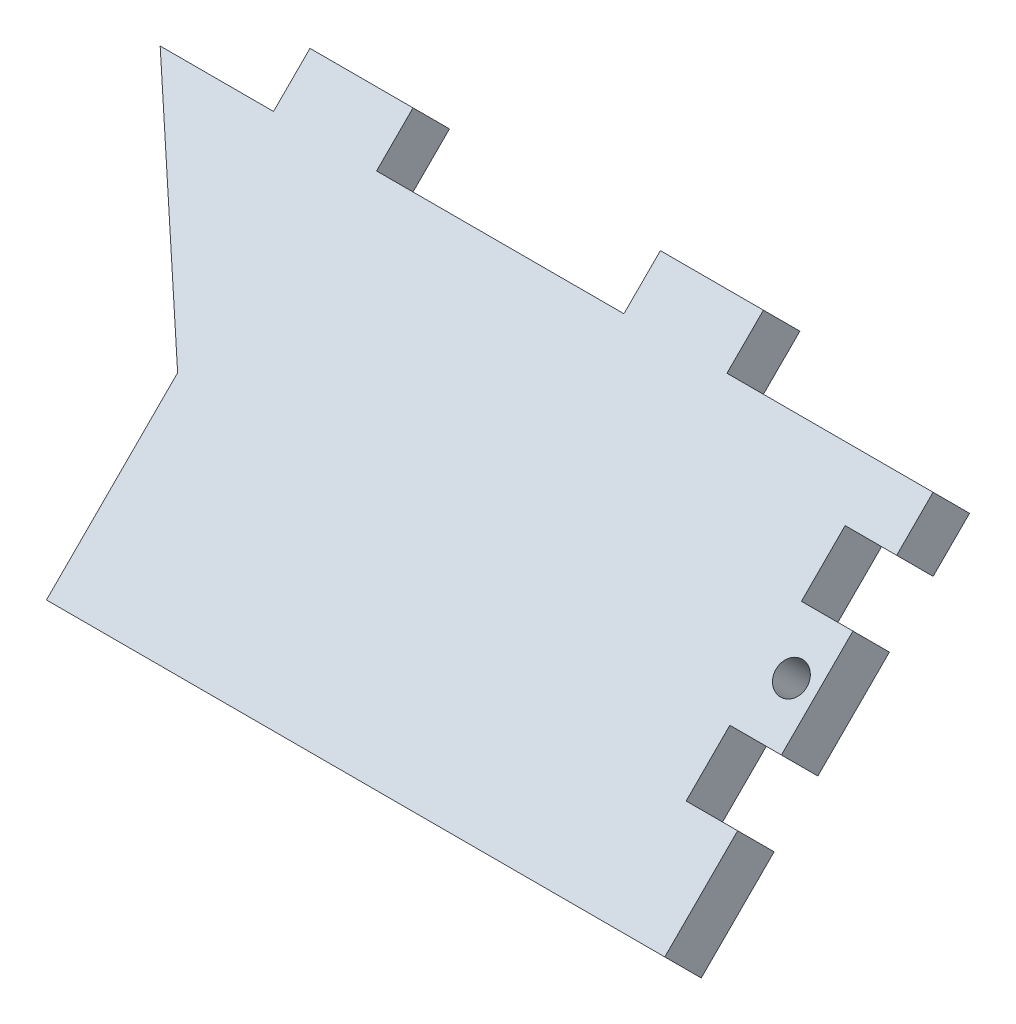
ISO-10303-21;
HEADER;
FILE_DESCRIPTION(('STEP AP214'),'2;1');
FILE_NAME('part.step','',(''),(''),'','','');
FILE_SCHEMA(('AUTOMOTIVE_DESIGN { 1 0 10303 214 1 1 1 1 }'));
ENDSEC;
DATA;
#1=APPLICATION_CONTEXT('core data for automotive mechanical design processes');
#2=APPLICATION_PROTOCOL_DEFINITION('international standard','automotive_design',2000,#1);
#3=PRODUCT_CONTEXT('',#1,'mechanical');
#4=PRODUCT('Part','Part','',(#3));
#5=PRODUCT_RELATED_PRODUCT_CATEGORY('part','',(#4));
#6=PRODUCT_DEFINITION_FORMATION('','',#4);
#7=PRODUCT_DEFINITION_CONTEXT('part definition',#1,'design');
#8=PRODUCT_DEFINITION('design','',#6,#7);
#9=PRODUCT_DEFINITION_SHAPE('','',#8);
#10=(LENGTH_UNIT() NAMED_UNIT(*) SI_UNIT(.MILLI.,.METRE.));
#11=(NAMED_UNIT(*) PLANE_ANGLE_UNIT() SI_UNIT($,.RADIAN.));
#12=(NAMED_UNIT(*) SI_UNIT($,.STERADIAN.) SOLID_ANGLE_UNIT());
#13=UNCERTAINTY_MEASURE_WITH_UNIT(LENGTH_MEASURE(1.E-05),#10,'distance_accuracy_value','');
#14=(GEOMETRIC_REPRESENTATION_CONTEXT(3) GLOBAL_UNCERTAINTY_ASSIGNED_CONTEXT((#13)) GLOBAL_UNIT_ASSIGNED_CONTEXT((#10,
#11,#12)) REPRESENTATION_CONTEXT('',''));
#15=CARTESIAN_POINT('',(0.,0.,0.));
#16=DIRECTION('',(0.,0.,1.));
#17=DIRECTION('',(1.,0.,0.));
#18=AXIS2_PLACEMENT_3D('',#15,#16,#17);
#19=CARTESIAN_POINT('',(-6.35,4.49012806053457,4.49012806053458));
#20=DIRECTION('',(1.,0.,0.));
#21=DIRECTION('',(0.,1.,0.));
#22=AXIS2_PLACEMENT_3D('',#19,#20,#21);
#23=PLANE('',#22);
#24=DIRECTION('',(0.,-0.707106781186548,0.707106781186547));
#25=VECTOR('',#24,1.);
#26=CARTESIAN_POINT('',(-6.35,0.,0.));
#27=LINE('',#26,#25);
#28=CARTESIAN_POINT('',(-6.35,14.3684097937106,-14.3684097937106));
#29=VERTEX_POINT('',#28);
#30=CARTESIAN_POINT('',(-6.35,8.98025612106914,-8.98025612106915));
#31=VERTEX_POINT('',#30);
#32=EDGE_CURVE('E226',#29,#31,#27,.T.);
#33=ORIENTED_EDGE('',*,*,#32,.F.);
#34=DIRECTION('',(0.,-0.707106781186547,-0.707106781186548));
#35=VECTOR('',#34,1.);
#36=CARTESIAN_POINT('',(-6.35,18.8585378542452,-9.87828173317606));
#37=LINE('',#36,#35);
#38=CARTESIAN_POINT('',(-6.35,18.8585378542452,-9.87828173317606));
#39=VERTEX_POINT('',#38);
#40=EDGE_CURVE('E11',#39,#29,#37,.T.);
#41=ORIENTED_EDGE('',*,*,#40,.F.);
#42=DIRECTION('',(0.,-0.707106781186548,0.707106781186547));
#43=VECTOR('',#42,1.);
#44=CARTESIAN_POINT('',(-6.35,4.49012806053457,4.49012806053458));
#45=LINE('',#44,#43);
#46=CARTESIAN_POINT('',(-6.35,13.4703841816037,-4.49012806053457));
#47=VERTEX_POINT('',#46);
#48=EDGE_CURVE('E296',#39,#47,#45,.T.);
#49=ORIENTED_EDGE('',*,*,#48,.T.);
#50=DIRECTION('',(0.,-0.707106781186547,-0.707106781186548));
#51=VECTOR('',#50,1.);
#52=CARTESIAN_POINT('',(-6.35,13.4703841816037,-4.49012806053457));
#53=LINE('',#52,#51);
#54=EDGE_CURVE('E137',#47,#31,#53,.T.);
#55=ORIENTED_EDGE('',*,*,#54,.T.);
#56=EDGE_LOOP('',(#33,#41,#49,#55));
#57=FACE_BOUND('',#56,.T.);
#58=ADVANCED_FACE('F47',(#57),#23,.T.);
#59=CARTESIAN_POINT('',(0.,18.8585378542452,-9.87828173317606));
#60=DIRECTION('',(0.,-0.707106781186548,0.707106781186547));
#61=DIRECTION('',(0.,-0.707106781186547,-0.707106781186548));
#62=AXIS2_PLACEMENT_3D('',#59,#60,#61);
#63=PLANE('',#62);
#64=DIRECTION('',(-1.,0.,0.));
#65=VECTOR('',#64,1.);
#66=CARTESIAN_POINT('',(0.,14.3684097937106,-14.3684097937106));
#67=LINE('',#66,#65);
#68=CARTESIAN_POINT('',(0.,14.3684097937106,-14.3684097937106));
#69=VERTEX_POINT('',#68);
#70=EDGE_CURVE('E230',#69,#29,#67,.T.);
#71=ORIENTED_EDGE('',*,*,#70,.F.);
#72=DIRECTION('',(0.,-0.707106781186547,-0.707106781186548));
#73=VECTOR('',#72,1.);
#74=CARTESIAN_POINT('',(0.,18.8585378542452,-9.87828173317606));
#75=LINE('',#74,#73);
#76=CARTESIAN_POINT('',(0.,18.8585378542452,-9.87828173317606));
#77=VERTEX_POINT('',#76);
#78=EDGE_CURVE('E56',#77,#69,#75,.T.);
#79=ORIENTED_EDGE('',*,*,#78,.F.);
#80=DIRECTION('',(-1.,0.,0.));
#81=VECTOR('',#80,1.);
#82=CARTESIAN_POINT('',(0.,18.8585378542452,-9.87828173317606));
#83=LINE('',#82,#81);
#84=EDGE_CURVE('E364',#77,#39,#83,.T.);
#85=ORIENTED_EDGE('',*,*,#84,.T.);
#86=ORIENTED_EDGE('',*,*,#40,.T.);
#87=EDGE_LOOP('',(#71,#79,#85,#86));
#88=FACE_BOUND('',#87,.T.);
#89=ADVANCED_FACE('F363',(#88),#63,.T.);
#90=CARTESIAN_POINT('',(0.,4.49012806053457,4.49012806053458));
#91=DIRECTION('',(-1.,0.,0.));
#92=DIRECTION('',(0.,-1.,0.));
#93=AXIS2_PLACEMENT_3D('',#90,#91,#92);
#94=PLANE('',#93);
#95=DIRECTION('',(0.,0.707106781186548,-0.707106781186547));
#96=VECTOR('',#95,1.);
#97=CARTESIAN_POINT('',(0.,0.,0.));
#98=LINE('',#97,#96);
#99=CARTESIAN_POINT('',(0.,23.1870213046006,-23.1870213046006));
#100=VERTEX_POINT('',#99);
#101=EDGE_CURVE('E235',#69,#100,#98,.T.);
#102=ORIENTED_EDGE('',*,*,#101,.T.);
#103=DIRECTION('',(0.,-0.707106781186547,-0.707106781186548));
#104=VECTOR('',#103,1.);
#105=CARTESIAN_POINT('',(0.,27.6771493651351,-18.696893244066));
#106=LINE('',#105,#104);
#107=CARTESIAN_POINT('',(0.,27.6771493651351,-18.696893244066));
#108=VERTEX_POINT('',#107);
#109=EDGE_CURVE('E347',#108,#100,#106,.T.);
#110=ORIENTED_EDGE('',*,*,#109,.F.);
#111=DIRECTION('',(0.,0.707106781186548,-0.707106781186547));
#112=VECTOR('',#111,1.);
#113=CARTESIAN_POINT('',(0.,4.49012806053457,4.49012806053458));
#114=LINE('',#113,#112);
#115=EDGE_CURVE('E212',#77,#108,#114,.T.);
#116=ORIENTED_EDGE('',*,*,#115,.F.);
#117=ORIENTED_EDGE('',*,*,#78,.T.);
#118=EDGE_LOOP('',(#102,#110,#116,#117));
#119=FACE_BOUND('',#118,.T.);
#120=ADVANCED_FACE('F354',(#119),#94,.F.);
#121=CARTESIAN_POINT('',(0.,27.6771493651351,-18.696893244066));
#122=DIRECTION('',(0.,-0.707106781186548,0.707106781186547));
#123=DIRECTION('',(0.,-0.707106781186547,-0.707106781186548));
#124=AXIS2_PLACEMENT_3D('',#121,#122,#123);
#125=PLANE('',#124);
#126=DIRECTION('',(-1.,0.,0.));
#127=VECTOR('',#126,1.);
#128=CARTESIAN_POINT('',(0.,23.1870213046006,-23.1870213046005));
#129=LINE('',#128,#127);
#130=CARTESIAN_POINT('',(-6.35,23.1870213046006,-23.1870213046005));
#131=VERTEX_POINT('',#130);
#132=EDGE_CURVE('E238',#100,#131,#129,.T.);
#133=ORIENTED_EDGE('',*,*,#132,.T.);
#134=DIRECTION('',(0.,-0.707106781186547,-0.707106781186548));
#135=VECTOR('',#134,1.);
#136=CARTESIAN_POINT('',(-6.35,27.6771493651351,-18.696893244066));
#137=LINE('',#136,#135);
#138=CARTESIAN_POINT('',(-6.35,27.6771493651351,-18.696893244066));
#139=VERTEX_POINT('',#138);
#140=EDGE_CURVE('E344',#139,#131,#137,.T.);
#141=ORIENTED_EDGE('',*,*,#140,.F.);
#142=DIRECTION('',(-1.,0.,0.));
#143=VECTOR('',#142,1.);
#144=CARTESIAN_POINT('',(0.,27.6771493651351,-18.696893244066));
#145=LINE('',#144,#143);
#146=EDGE_CURVE('E377',#108,#139,#145,.T.);
#147=ORIENTED_EDGE('',*,*,#146,.F.);
#148=ORIENTED_EDGE('',*,*,#109,.T.);
#149=EDGE_LOOP('',(#133,#141,#147,#148));
#150=FACE_BOUND('',#149,.T.);
#151=ADVANCED_FACE('F500',(#150),#125,.F.);
#152=CARTESIAN_POINT('',(-6.35,4.49012806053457,4.49012806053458));
#153=DIRECTION('',(1.,0.,0.));
#154=DIRECTION('',(0.,1.,0.));
#155=AXIS2_PLACEMENT_3D('',#152,#153,#154);
#156=PLANE('',#155);
#157=DIRECTION('',(0.,-0.707106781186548,0.707106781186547));
#158=VECTOR('',#157,1.);
#159=CARTESIAN_POINT('',(-6.35,0.,0.));
#160=LINE('',#159,#158);
#161=CARTESIAN_POINT('',(-6.35,28.575174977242,-28.575174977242));
#162=VERTEX_POINT('',#161);
#163=EDGE_CURVE('E243',#162,#131,#160,.T.);
#164=ORIENTED_EDGE('',*,*,#163,.F.);
#165=DIRECTION('',(0.,-0.707106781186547,-0.707106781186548));
#166=VECTOR('',#165,1.);
#167=CARTESIAN_POINT('',(-6.35,33.0653030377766,-24.0850469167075));
#168=LINE('',#167,#166);
#169=CARTESIAN_POINT('',(-6.35,33.0653030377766,-24.0850469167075));
#170=VERTEX_POINT('',#169);
#171=EDGE_CURVE('E341',#170,#162,#168,.T.);
#172=ORIENTED_EDGE('',*,*,#171,.F.);
#173=DIRECTION('',(0.,-0.707106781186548,0.707106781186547));
#174=VECTOR('',#173,1.);
#175=CARTESIAN_POINT('',(-6.35,4.49012806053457,4.49012806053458));
#176=LINE('',#175,#174);
#177=EDGE_CURVE('E380',#170,#139,#176,.T.);
#178=ORIENTED_EDGE('',*,*,#177,.T.);
#179=ORIENTED_EDGE('',*,*,#140,.T.);
#180=EDGE_LOOP('',(#164,#172,#178,#179));
#181=FACE_BOUND('',#180,.T.);
#182=ADVANCED_FACE('F505',(#181),#156,.T.);
#183=CARTESIAN_POINT('',(0.,33.0653030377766,-24.0850469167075));
#184=DIRECTION('',(0.,-0.707106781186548,0.707106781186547));
#185=DIRECTION('',(0.,-0.707106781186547,-0.707106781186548));
#186=AXIS2_PLACEMENT_3D('',#183,#184,#185);
#187=PLANE('',#186);
#188=DIRECTION('',(-1.,0.,0.));
#189=VECTOR('',#188,1.);
#190=CARTESIAN_POINT('',(0.,28.575174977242,-28.575174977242));
#191=LINE('',#190,#189);
#192=CARTESIAN_POINT('',(0.,28.575174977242,-28.575174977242));
#193=VERTEX_POINT('',#192);
#194=EDGE_CURVE('E247',#193,#162,#191,.T.);
#195=ORIENTED_EDGE('',*,*,#194,.F.);
#196=DIRECTION('',(0.,-0.707106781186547,-0.707106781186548));
#197=VECTOR('',#196,1.);
#198=CARTESIAN_POINT('',(0.,33.0653030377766,-24.0850469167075));
#199=LINE('',#198,#197);
#200=CARTESIAN_POINT('',(0.,33.0653030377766,-24.0850469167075));
#201=VERTEX_POINT('',#200);
#202=EDGE_CURVE('E338',#201,#193,#199,.T.);
#203=ORIENTED_EDGE('',*,*,#202,.F.);
#204=DIRECTION('',(-1.,0.,0.));
#205=VECTOR('',#204,1.);
#206=CARTESIAN_POINT('',(0.,33.0653030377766,-24.0850469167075));
#207=LINE('',#206,#205);
#208=EDGE_CURVE('E384',#201,#170,#207,.T.);
#209=ORIENTED_EDGE('',*,*,#208,.T.);
#210=ORIENTED_EDGE('',*,*,#171,.T.);
#211=EDGE_LOOP('',(#195,#203,#209,#210));
#212=FACE_BOUND('',#211,.T.);
#213=ADVANCED_FACE('F509',(#212),#187,.T.);
#214=CARTESIAN_POINT('',(0.,33.0635069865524,-33.0635069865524));
#215=VERTEX_POINT('',#214);
#216=EDGE_CURVE('E239',#193,#215,#98,.T.);
#217=ORIENTED_EDGE('',*,*,#216,.T.);
#218=DIRECTION('',(0.,-0.707106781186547,-0.707106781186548));
#219=VECTOR('',#218,1.);
#220=CARTESIAN_POINT('',(0.,37.553635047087,-28.5733789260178));
#221=LINE('',#220,#219);
#222=CARTESIAN_POINT('',(0.,37.553635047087,-28.5733789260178));
#223=VERTEX_POINT('',#222);
#224=EDGE_CURVE('E335',#223,#215,#221,.T.);
#225=ORIENTED_EDGE('',*,*,#224,.F.);
#226=EDGE_CURVE('E211',#201,#223,#114,.T.);
#227=ORIENTED_EDGE('',*,*,#226,.F.);
#228=ORIENTED_EDGE('',*,*,#202,.T.);
#229=EDGE_LOOP('',(#217,#225,#227,#228));
#230=FACE_BOUND('',#229,.T.);
#231=ADVANCED_FACE('F472',(#230),#94,.F.);
#232=CARTESIAN_POINT('',(0.,37.553635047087,-28.5733789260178));
#233=DIRECTION('',(0.,0.707106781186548,-0.707106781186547));
#234=DIRECTION('',(0.,0.707106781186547,0.707106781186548));
#235=AXIS2_PLACEMENT_3D('',#232,#233,#234);
#236=PLANE('',#235);
#237=DIRECTION('',(1.,0.,0.));
#238=VECTOR('',#237,1.);
#239=CARTESIAN_POINT('',(0.,33.0635069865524,-33.0635069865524));
#240=LINE('',#239,#238);
#241=CARTESIAN_POINT('',(-25.4,33.0635069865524,-33.0635069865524));
#242=VERTEX_POINT('',#241);
#243=EDGE_CURVE('E251',#242,#215,#240,.T.);
#244=ORIENTED_EDGE('',*,*,#243,.F.);
#245=DIRECTION('',(0.,-0.707106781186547,-0.707106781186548));
#246=VECTOR('',#245,1.);
#247=CARTESIAN_POINT('',(-25.4,37.553635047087,-28.5733789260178));
#248=LINE('',#247,#246);
#249=CARTESIAN_POINT('',(-25.4,37.553635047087,-28.5733789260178));
#250=VERTEX_POINT('',#249);
#251=EDGE_CURVE('E332',#250,#242,#248,.T.);
#252=ORIENTED_EDGE('',*,*,#251,.F.);
#253=DIRECTION('',(1.,0.,0.));
#254=VECTOR('',#253,1.);
#255=CARTESIAN_POINT('',(0.,37.553635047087,-28.5733789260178));
#256=LINE('',#255,#254);
#257=EDGE_CURVE('E388',#250,#223,#256,.T.);
#258=ORIENTED_EDGE('',*,*,#257,.T.);
#259=ORIENTED_EDGE('',*,*,#224,.T.);
#260=EDGE_LOOP('',(#244,#252,#258,#259));
#261=FACE_BOUND('',#260,.T.);
#262=ADVANCED_FACE('F467',(#261),#236,.T.);
#263=CARTESIAN_POINT('',(-25.4,4.49012806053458,4.49012806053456));
#264=DIRECTION('',(1.,0.,0.));
#265=DIRECTION('',(0.,1.,0.));
#266=AXIS2_PLACEMENT_3D('',#263,#264,#265);
#267=PLANE('',#266);
#268=DIRECTION('',(0.,-0.707106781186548,0.707106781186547));
#269=VECTOR('',#268,1.);
#270=CARTESIAN_POINT('',(-25.4,0.,0.));
#271=LINE('',#270,#269);
#272=CARTESIAN_POINT('',(-25.4,37.553635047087,-37.553635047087));
#273=VERTEX_POINT('',#272);
#274=EDGE_CURVE('E255',#273,#242,#271,.T.);
#275=ORIENTED_EDGE('',*,*,#274,.F.);
#276=DIRECTION('',(0.,-0.707106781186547,-0.707106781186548));
#277=VECTOR('',#276,1.);
#278=CARTESIAN_POINT('',(-25.4,42.0437631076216,-33.0635069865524));
#279=LINE('',#278,#277);
#280=CARTESIAN_POINT('',(-25.4,42.0437631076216,-33.0635069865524));
#281=VERTEX_POINT('',#280);
#282=EDGE_CURVE('E329',#281,#273,#279,.T.);
#283=ORIENTED_EDGE('',*,*,#282,.F.);
#284=DIRECTION('',(0.,-0.707106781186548,0.707106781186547));
#285=VECTOR('',#284,1.);
#286=CARTESIAN_POINT('',(-25.4,4.49012806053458,4.49012806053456));
#287=LINE('',#286,#285);
#288=EDGE_CURVE('E392',#281,#250,#287,.T.);
#289=ORIENTED_EDGE('',*,*,#288,.T.);
#290=ORIENTED_EDGE('',*,*,#251,.T.);
#291=EDGE_LOOP('',(#275,#283,#289,#290));
#292=FACE_BOUND('',#291,.T.);
#293=ADVANCED_FACE('F461',(#292),#267,.T.);
#294=CARTESIAN_POINT('',(0.,42.0437631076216,-33.0635069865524));
#295=DIRECTION('',(0.,-0.707106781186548,0.707106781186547));
#296=DIRECTION('',(0.,-0.707106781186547,-0.707106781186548));
#297=AXIS2_PLACEMENT_3D('',#294,#295,#296);
#298=PLANE('',#297);
#299=DIRECTION('',(-1.,0.,0.));
#300=VECTOR('',#299,1.);
#301=CARTESIAN_POINT('',(0.,37.553635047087,-37.553635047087));
#302=LINE('',#301,#300);
#303=CARTESIAN_POINT('',(-38.1,37.553635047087,-37.553635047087));
#304=VERTEX_POINT('',#303);
#305=EDGE_CURVE('E259',#273,#304,#302,.T.);
#306=ORIENTED_EDGE('',*,*,#305,.T.);
#307=DIRECTION('',(0.,-0.707106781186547,-0.707106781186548));
#308=VECTOR('',#307,1.);
#309=CARTESIAN_POINT('',(-38.1,42.0437631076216,-33.0635069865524));
#310=LINE('',#309,#308);
#311=CARTESIAN_POINT('',(-38.1,42.0437631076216,-33.0635069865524));
#312=VERTEX_POINT('',#311);
#313=EDGE_CURVE('E325',#312,#304,#310,.T.);
#314=ORIENTED_EDGE('',*,*,#313,.F.);
#315=DIRECTION('',(-1.,0.,0.));
#316=VECTOR('',#315,1.);
#317=CARTESIAN_POINT('',(0.,42.0437631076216,-33.0635069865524));
#318=LINE('',#317,#316);
#319=EDGE_CURVE('E396',#281,#312,#318,.T.);
#320=ORIENTED_EDGE('',*,*,#319,.F.);
#321=ORIENTED_EDGE('',*,*,#282,.T.);
#322=EDGE_LOOP('',(#306,#314,#320,#321));
#323=FACE_BOUND('',#322,.T.);
#324=ADVANCED_FACE('F458',(#323),#298,.F.);
#325=CARTESIAN_POINT('',(-38.1,4.49012806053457,4.49012806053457));
#326=DIRECTION('',(1.,0.,0.));
#327=DIRECTION('',(0.,0.,-1.));
#328=AXIS2_PLACEMENT_3D('',#325,#326,#327);
#329=PLANE('',#328);
#330=DIRECTION('',(0.,-0.707106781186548,0.707106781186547));
#331=VECTOR('',#330,1.);
#332=CARTESIAN_POINT('',(-38.1,0.,0.));
#333=LINE('',#332,#331);
#334=CARTESIAN_POINT('',(-38.1,33.0635069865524,-33.0635069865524));
#335=VERTEX_POINT('',#334);
#336=EDGE_CURVE('E262',#304,#335,#333,.T.);
#337=ORIENTED_EDGE('',*,*,#336,.T.);
#338=DIRECTION('',(0.,-0.707106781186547,-0.707106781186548));
#339=VECTOR('',#338,1.);
#340=CARTESIAN_POINT('',(-38.1,37.553635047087,-28.5733789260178));
#341=LINE('',#340,#339);
#342=CARTESIAN_POINT('',(-38.1,37.553635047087,-28.5733789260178));
#343=VERTEX_POINT('',#342);
#344=EDGE_CURVE('E322',#343,#335,#341,.T.);
#345=ORIENTED_EDGE('',*,*,#344,.F.);
#346=DIRECTION('',(0.,-0.707106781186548,0.707106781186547));
#347=VECTOR('',#346,1.);
#348=CARTESIAN_POINT('',(-38.1,4.49012806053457,4.49012806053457));
#349=LINE('',#348,#347);
#350=EDGE_CURVE('E399',#312,#343,#349,.T.);
#351=ORIENTED_EDGE('',*,*,#350,.F.);
#352=ORIENTED_EDGE('',*,*,#313,.T.);
#353=EDGE_LOOP('',(#337,#345,#351,#352));
#354=FACE_BOUND('',#353,.T.);
#355=ADVANCED_FACE('F453',(#354),#329,.F.);
#356=CARTESIAN_POINT('',(0.,37.553635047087,-28.5733789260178));
#357=DIRECTION('',(0.,0.707106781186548,-0.707106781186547));
#358=DIRECTION('',(0.,0.707106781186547,0.707106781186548));
#359=AXIS2_PLACEMENT_3D('',#356,#357,#358);
#360=PLANE('',#359);
#361=DIRECTION('',(1.,0.,0.));
#362=VECTOR('',#361,1.);
#363=CARTESIAN_POINT('',(0.,33.0635069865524,-33.0635069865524));
#364=LINE('',#363,#362);
#365=CARTESIAN_POINT('',(-68.58,33.0635069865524,-33.0635069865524));
#366=VERTEX_POINT('',#365);
#367=EDGE_CURVE('E267',#366,#335,#364,.T.);
#368=ORIENTED_EDGE('',*,*,#367,.F.);
#369=DIRECTION('',(0.,-0.707106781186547,-0.707106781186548));
#370=VECTOR('',#369,1.);
#371=CARTESIAN_POINT('',(-68.58,37.553635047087,-28.5733789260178));
#372=LINE('',#371,#370);
#373=CARTESIAN_POINT('',(-68.58,37.553635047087,-28.5733789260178));
#374=VERTEX_POINT('',#373);
#375=EDGE_CURVE('E319',#374,#366,#372,.T.);
#376=ORIENTED_EDGE('',*,*,#375,.F.);
#377=DIRECTION('',(1.,0.,0.));
#378=VECTOR('',#377,1.);
#379=CARTESIAN_POINT('',(0.,37.553635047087,-28.5733789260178));
#380=LINE('',#379,#378);
#381=EDGE_CURVE('E403',#374,#343,#380,.T.);
#382=ORIENTED_EDGE('',*,*,#381,.T.);
#383=ORIENTED_EDGE('',*,*,#344,.T.);
#384=EDGE_LOOP('',(#368,#376,#382,#383));
#385=FACE_BOUND('',#384,.T.);
#386=ADVANCED_FACE('F447',(#385),#360,.T.);
#387=CARTESIAN_POINT('',(-68.58,4.49012806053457,4.49012806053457));
#388=DIRECTION('',(1.,0.,0.));
#389=DIRECTION('',(0.,0.,-1.));
#390=AXIS2_PLACEMENT_3D('',#387,#388,#389);
#391=PLANE('',#390);
#392=DIRECTION('',(0.,-0.707106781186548,0.707106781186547));
#393=VECTOR('',#392,1.);
#394=CARTESIAN_POINT('',(-68.58,0.,0.));
#395=LINE('',#394,#393);
#396=CARTESIAN_POINT('',(-68.58,37.553635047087,-37.553635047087));
#397=VERTEX_POINT('',#396);
#398=EDGE_CURVE('E271',#397,#366,#395,.T.);
#399=ORIENTED_EDGE('',*,*,#398,.F.);
#400=DIRECTION('',(0.,-0.707106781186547,-0.707106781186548));
#401=VECTOR('',#400,1.);
#402=CARTESIAN_POINT('',(-68.58,42.0437631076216,-33.0635069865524));
#403=LINE('',#402,#401);
#404=CARTESIAN_POINT('',(-68.58,42.0437631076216,-33.0635069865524));
#405=VERTEX_POINT('',#404);
#406=EDGE_CURVE('E316',#405,#397,#403,.T.);
#407=ORIENTED_EDGE('',*,*,#406,.F.);
#408=DIRECTION('',(0.,-0.707106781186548,0.707106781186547));
#409=VECTOR('',#408,1.);
#410=CARTESIAN_POINT('',(-68.58,4.49012806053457,4.49012806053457));
#411=LINE('',#410,#409);
#412=EDGE_CURVE('E407',#405,#374,#411,.T.);
#413=ORIENTED_EDGE('',*,*,#412,.T.);
#414=ORIENTED_EDGE('',*,*,#375,.T.);
#415=EDGE_LOOP('',(#399,#407,#413,#414));
#416=FACE_BOUND('',#415,.T.);
#417=ADVANCED_FACE('F441',(#416),#391,.T.);
#418=CARTESIAN_POINT('',(-81.28,37.553635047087,-37.553635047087));
#419=VERTEX_POINT('',#418);
#420=EDGE_CURVE('E263',#397,#419,#302,.T.);
#421=ORIENTED_EDGE('',*,*,#420,.T.);
#422=DIRECTION('',(0.,-0.707106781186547,-0.707106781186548));
#423=VECTOR('',#422,1.);
#424=CARTESIAN_POINT('',(-81.28,42.0437631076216,-33.0635069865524));
#425=LINE('',#424,#423);
#426=CARTESIAN_POINT('',(-81.28,42.0437631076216,-33.0635069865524));
#427=VERTEX_POINT('',#426);
#428=EDGE_CURVE('E312',#427,#419,#425,.T.);
#429=ORIENTED_EDGE('',*,*,#428,.F.);
#430=EDGE_CURVE('E400',#405,#427,#318,.T.);
#431=ORIENTED_EDGE('',*,*,#430,.F.);
#432=ORIENTED_EDGE('',*,*,#406,.T.);
#433=EDGE_LOOP('',(#421,#429,#431,#432));
#434=FACE_BOUND('',#433,.T.);
#435=ADVANCED_FACE('F524',(#434),#298,.F.);
#436=CARTESIAN_POINT('',(-81.2800000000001,4.4901280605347,4.49012806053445));
#437=DIRECTION('',(1.,0.,0.));
#438=DIRECTION('',(0.,1.,0.));
#439=AXIS2_PLACEMENT_3D('',#436,#437,#438);
#440=PLANE('',#439);
#441=DIRECTION('',(0.,-0.707106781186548,0.707106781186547));
#442=VECTOR('',#441,1.);
#443=CARTESIAN_POINT('',(-81.2800000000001,1.21558913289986E-13,-1.29655880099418E-13));
#444=LINE('',#443,#442);
#445=CARTESIAN_POINT('',(-81.28,33.0635069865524,-33.0635069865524));
#446=VERTEX_POINT('',#445);
#447=EDGE_CURVE('E275',#419,#446,#444,.T.);
#448=ORIENTED_EDGE('',*,*,#447,.T.);
#449=DIRECTION('',(0.,-0.707106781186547,-0.707106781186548));
#450=VECTOR('',#449,1.);
#451=CARTESIAN_POINT('',(-81.28,37.553635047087,-28.5733789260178));
#452=LINE('',#451,#450);
#453=CARTESIAN_POINT('',(-81.28,37.553635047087,-28.5733789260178));
#454=VERTEX_POINT('',#453);
#455=EDGE_CURVE('E309',#454,#446,#452,.T.);
#456=ORIENTED_EDGE('',*,*,#455,.F.);
#457=DIRECTION('',(0.,-0.707106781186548,0.707106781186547));
#458=VECTOR('',#457,1.);
#459=CARTESIAN_POINT('',(-81.2800000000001,4.4901280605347,4.49012806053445));
#460=LINE('',#459,#458);
#461=EDGE_CURVE('E411',#427,#454,#460,.T.);
#462=ORIENTED_EDGE('',*,*,#461,.F.);
#463=ORIENTED_EDGE('',*,*,#428,.T.);
#464=EDGE_LOOP('',(#448,#456,#462,#463));
#465=FACE_BOUND('',#464,.T.);
#466=ADVANCED_FACE('F434',(#465),#440,.F.);
#467=CARTESIAN_POINT('',(0.,37.553635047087,-28.5733789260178));
#468=DIRECTION('',(0.,0.707106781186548,-0.707106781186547));
#469=DIRECTION('',(0.,0.707106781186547,0.707106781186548));
#470=AXIS2_PLACEMENT_3D('',#467,#468,#469);
#471=PLANE('',#470);
#472=DIRECTION('',(1.,0.,0.));
#473=VECTOR('',#472,1.);
#474=CARTESIAN_POINT('',(0.,33.0635069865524,-33.0635069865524));
#475=LINE('',#474,#473);
#476=CARTESIAN_POINT('',(-95.25,33.0635069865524,-33.0635069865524));
#477=VERTEX_POINT('',#476);
#478=EDGE_CURVE('E279',#477,#446,#475,.T.);
#479=ORIENTED_EDGE('',*,*,#478,.F.);
#480=DIRECTION('',(0.,-0.707106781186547,-0.707106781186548));
#481=VECTOR('',#480,1.);
#482=CARTESIAN_POINT('',(-95.25,37.553635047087,-28.5733789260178));
#483=LINE('',#482,#481);
#484=CARTESIAN_POINT('',(-95.25,37.553635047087,-28.5733789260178));
#485=VERTEX_POINT('',#484);
#486=EDGE_CURVE('E306',#485,#477,#483,.T.);
#487=ORIENTED_EDGE('',*,*,#486,.F.);
#488=DIRECTION('',(1.,0.,0.));
#489=VECTOR('',#488,1.);
#490=CARTESIAN_POINT('',(0.,37.553635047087,-28.5733789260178));
#491=LINE('',#490,#489);
#492=EDGE_CURVE('E414',#485,#454,#491,.T.);
#493=ORIENTED_EDGE('',*,*,#492,.T.);
#494=ORIENTED_EDGE('',*,*,#455,.T.);
#495=EDGE_LOOP('',(#479,#487,#493,#494));
#496=FACE_BOUND('',#495,.T.);
#497=ADVANCED_FACE('F430',(#496),#471,.T.);
#498=CARTESIAN_POINT('',(-35.452297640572,-15.4922505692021,24.4725066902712));
#499=DIRECTION('',(0.781970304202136,0.440750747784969,-0.440750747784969));
#500=DIRECTION('',(-0.491016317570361,0.871150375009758,0.));
#501=AXIS2_PLACEMENT_3D('',#498,#499,#500);
#502=PLANE('',#501);
#503=DIRECTION('',(0.623315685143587,-0.552936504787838,0.552936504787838));
#504=VECTOR('',#503,1.);
#505=CARTESIAN_POINT('',(-35.452297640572,-19.9823786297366,19.9823786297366));
#506=LINE('',#505,#504);
#507=CARTESIAN_POINT('',(-76.2,16.1644610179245,-16.1644610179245));
#508=VERTEX_POINT('',#507);
#509=EDGE_CURVE('E283',#477,#508,#506,.T.);
#510=ORIENTED_EDGE('',*,*,#509,.T.);
#511=DIRECTION('',(0.,-0.707106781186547,-0.707106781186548));
#512=VECTOR('',#511,1.);
#513=CARTESIAN_POINT('',(-76.2,20.654589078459,-11.6743329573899));
#514=LINE('',#513,#512);
#515=CARTESIAN_POINT('',(-76.2,20.654589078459,-11.6743329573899));
#516=VERTEX_POINT('',#515);
#517=EDGE_CURVE('E303',#516,#508,#514,.T.);
#518=ORIENTED_EDGE('',*,*,#517,.F.);
#519=DIRECTION('',(0.623315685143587,-0.552936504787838,0.552936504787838));
#520=VECTOR('',#519,1.);
#521=CARTESIAN_POINT('',(-35.452297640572,-15.4922505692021,24.4725066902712));
#522=LINE('',#521,#520);
#523=EDGE_CURVE('E220',#485,#516,#522,.T.);
#524=ORIENTED_EDGE('',*,*,#523,.F.);
#525=ORIENTED_EDGE('',*,*,#486,.T.);
#526=EDGE_LOOP('',(#510,#518,#524,#525));
#527=FACE_BOUND('',#526,.T.);
#528=ADVANCED_FACE('F422',(#527),#502,.F.);
#529=CARTESIAN_POINT('',(-76.2,4.49012806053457,4.49012806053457));
#530=DIRECTION('',(-1.,0.,0.));
#531=DIRECTION('',(0.,0.,1.));
#532=AXIS2_PLACEMENT_3D('',#529,#530,#531);
#533=PLANE('',#532);
#534=DIRECTION('',(0.,0.707106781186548,-0.707106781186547));
#535=VECTOR('',#534,1.);
#536=CARTESIAN_POINT('',(-76.2,0.,0.));
#537=LINE('',#536,#535);
#538=CARTESIAN_POINT('',(-76.2,0.,0.));
#539=VERTEX_POINT('',#538);
#540=EDGE_CURVE('E287',#539,#508,#537,.T.);
#541=ORIENTED_EDGE('',*,*,#540,.F.);
#542=DIRECTION('',(0.,-0.707106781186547,-0.707106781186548));
#543=VECTOR('',#542,1.);
#544=CARTESIAN_POINT('',(-76.2,4.49012806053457,4.49012806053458));
#545=LINE('',#544,#543);
#546=CARTESIAN_POINT('',(-76.2,4.49012806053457,4.49012806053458));
#547=VERTEX_POINT('',#546);
#548=EDGE_CURVE('E204',#547,#539,#545,.T.);
#549=ORIENTED_EDGE('',*,*,#548,.F.);
#550=DIRECTION('',(0.,0.707106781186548,-0.707106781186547));
#551=VECTOR('',#550,1.);
#552=CARTESIAN_POINT('',(-76.2,4.49012806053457,4.49012806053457));
#553=LINE('',#552,#551);
#554=EDGE_CURVE('E216',#547,#516,#553,.T.);
#555=ORIENTED_EDGE('',*,*,#554,.T.);
#556=ORIENTED_EDGE('',*,*,#517,.T.);
#557=EDGE_LOOP('',(#541,#549,#555,#556));
#558=FACE_BOUND('',#557,.T.);
#559=ADVANCED_FACE('F426',(#558),#533,.T.);
#560=CARTESIAN_POINT('',(0.,4.49012806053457,4.49012806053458));
#561=DIRECTION('',(0.,-0.707106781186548,0.707106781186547));
#562=DIRECTION('',(0.,-0.707106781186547,-0.707106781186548));
#563=AXIS2_PLACEMENT_3D('',#560,#561,#562);
#564=PLANE('',#563);
#565=DIRECTION('',(-1.,0.,0.));
#566=VECTOR('',#565,1.);
#567=CARTESIAN_POINT('',(0.,0.,0.));
#568=LINE('',#567,#566);
#569=CARTESIAN_POINT('',(0.,0.,0.));
#570=VERTEX_POINT('',#569);
#571=EDGE_CURVE('E202',#570,#539,#568,.T.);
#572=ORIENTED_EDGE('',*,*,#571,.F.);
#573=DIRECTION('',(0.,-0.707106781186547,-0.707106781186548));
#574=VECTOR('',#573,1.);
#575=CARTESIAN_POINT('',(0.,4.49012806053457,4.49012806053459));
#576=LINE('',#575,#574);
#577=CARTESIAN_POINT('',(0.,4.49012806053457,4.49012806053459));
#578=VERTEX_POINT('',#577);
#579=EDGE_CURVE('E196',#578,#570,#576,.T.);
#580=ORIENTED_EDGE('',*,*,#579,.F.);
#581=DIRECTION('',(-1.,0.,0.));
#582=VECTOR('',#581,1.);
#583=CARTESIAN_POINT('',(0.,4.49012806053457,4.49012806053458));
#584=LINE('',#583,#582);
#585=EDGE_CURVE('E200',#578,#547,#584,.T.);
#586=ORIENTED_EDGE('',*,*,#585,.T.);
#587=ORIENTED_EDGE('',*,*,#548,.T.);
#588=EDGE_LOOP('',(#572,#580,#586,#587));
#589=FACE_BOUND('',#588,.T.);
#590=ADVANCED_FACE('F198',(#589),#564,.T.);
#591=CARTESIAN_POINT('',(0.,8.98025612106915,-8.98025612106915));
#592=VERTEX_POINT('',#591);
#593=EDGE_CURVE('E130',#570,#592,#98,.T.);
#594=ORIENTED_EDGE('',*,*,#593,.T.);
#595=DIRECTION('',(0.,-0.707106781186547,-0.707106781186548));
#596=VECTOR('',#595,1.);
#597=CARTESIAN_POINT('',(0.,13.4703841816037,-4.49012806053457));
#598=LINE('',#597,#596);
#599=CARTESIAN_POINT('',(0.,13.4703841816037,-4.49012806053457));
#600=VERTEX_POINT('',#599);
#601=EDGE_CURVE('E205',#600,#592,#598,.T.);
#602=ORIENTED_EDGE('',*,*,#601,.F.);
#603=EDGE_CURVE('E207',#578,#600,#114,.T.);
#604=ORIENTED_EDGE('',*,*,#603,.F.);
#605=ORIENTED_EDGE('',*,*,#579,.T.);
#606=EDGE_LOOP('',(#594,#602,#604,#605));
#607=FACE_BOUND('',#606,.T.);
#608=ADVANCED_FACE('F208',(#607),#94,.F.);
#609=CARTESIAN_POINT('',(0.,13.4703841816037,-4.49012806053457));
#610=DIRECTION('',(0.,-0.707106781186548,0.707106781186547));
#611=DIRECTION('',(0.,-0.707106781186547,-0.707106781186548));
#612=AXIS2_PLACEMENT_3D('',#609,#610,#611);
#613=PLANE('',#612);
#614=DIRECTION('',(-1.,0.,0.));
#615=VECTOR('',#614,1.);
#616=CARTESIAN_POINT('',(0.,8.98025612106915,-8.98025612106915));
#617=LINE('',#616,#615);
#618=EDGE_CURVE('E293',#592,#31,#617,.T.);
#619=ORIENTED_EDGE('',*,*,#618,.T.);
#620=ORIENTED_EDGE('',*,*,#54,.F.);
#621=DIRECTION('',(-1.,0.,0.));
#622=VECTOR('',#621,1.);
#623=CARTESIAN_POINT('',(0.,13.4703841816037,-4.49012806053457));
#624=LINE('',#623,#622);
#625=EDGE_CURVE('E64',#600,#47,#624,.T.);
#626=ORIENTED_EDGE('',*,*,#625,.F.);
#627=ORIENTED_EDGE('',*,*,#601,.T.);
#628=EDGE_LOOP('',(#619,#620,#626,#627));
#629=FACE_BOUND('',#628,.T.);
#630=ADVANCED_FACE('F367',(#629),#613,.F.);
#631=CARTESIAN_POINT('',(0.,4.49012806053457,4.49012806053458));
#632=DIRECTION('',(0.,0.707106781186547,0.707106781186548));
#633=DIRECTION('',(0.,-0.707106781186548,0.707106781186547));
#634=AXIS2_PLACEMENT_3D('',#631,#632,#633);
#635=PLANE('',#634);
#636=CARTESIAN_POINT('',(-3.175,23.2678436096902,-14.287587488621));
#637=DIRECTION('',(0.,0.707106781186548,0.707106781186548));
#638=DIRECTION('',(0.,-0.707106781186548,0.707106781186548));
#639=AXIS2_PLACEMENT_3D('',#636,#637,#638);
#640=CIRCLE('',#639,1.905);
#641=CARTESIAN_POINT('',(-3.175,21.9208051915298,-12.9405490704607));
#642=VERTEX_POINT('',#641);
#643=EDGE_CURVE('E373',#642,#642,#640,.T.);
#644=ORIENTED_EDGE('',*,*,#643,.F.);
#645=EDGE_LOOP('',(#644));
#646=FACE_BOUND('',#645,.T.);
#647=ORIENTED_EDGE('',*,*,#48,.F.);
#648=ORIENTED_EDGE('',*,*,#84,.F.);
#649=ORIENTED_EDGE('',*,*,#115,.T.);
#650=ORIENTED_EDGE('',*,*,#146,.T.);
#651=ORIENTED_EDGE('',*,*,#177,.F.);
#652=ORIENTED_EDGE('',*,*,#208,.F.);
#653=ORIENTED_EDGE('',*,*,#226,.T.);
#654=ORIENTED_EDGE('',*,*,#257,.F.);
#655=ORIENTED_EDGE('',*,*,#288,.F.);
#656=ORIENTED_EDGE('',*,*,#319,.T.);
#657=ORIENTED_EDGE('',*,*,#350,.T.);
#658=ORIENTED_EDGE('',*,*,#381,.F.);
#659=ORIENTED_EDGE('',*,*,#412,.F.);
#660=ORIENTED_EDGE('',*,*,#430,.T.);
#661=ORIENTED_EDGE('',*,*,#461,.T.);
#662=ORIENTED_EDGE('',*,*,#492,.F.);
#663=ORIENTED_EDGE('',*,*,#523,.T.);
#664=ORIENTED_EDGE('',*,*,#554,.F.);
#665=ORIENTED_EDGE('',*,*,#585,.F.);
#666=ORIENTED_EDGE('',*,*,#603,.T.);
#667=ORIENTED_EDGE('',*,*,#625,.T.);
#668=EDGE_LOOP('',(#647,#648,#649,#650,#651,#652,#653,#654,#655,#656,#657,#658,#659,#660,#661,
#662,#663,#664,#665,#666,#667));
#669=FACE_BOUND('',#668,.T.);
#670=ADVANCED_FACE('F214',(#646,#669),#635,.T.);
#671=CARTESIAN_POINT('',(0.,0.,0.));
#672=DIRECTION('',(0.,0.707106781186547,0.707106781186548));
#673=DIRECTION('',(0.,-0.707106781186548,0.707106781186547));
#674=AXIS2_PLACEMENT_3D('',#671,#672,#673);
#675=PLANE('',#674);
#676=CARTESIAN_POINT('',(-3.175,18.7777155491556,-18.7777155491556));
#677=DIRECTION('',(0.,0.707106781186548,0.707106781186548));
#678=DIRECTION('',(0.,-0.707106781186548,0.707106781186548));
#679=AXIS2_PLACEMENT_3D('',#676,#677,#678);
#680=CIRCLE('',#679,1.905);
#681=CARTESIAN_POINT('',(-3.175,17.4306771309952,-17.4306771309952));
#682=VERTEX_POINT('',#681);
#683=EDGE_CURVE('E231',#682,#682,#680,.T.);
#684=ORIENTED_EDGE('',*,*,#683,.T.);
#685=EDGE_LOOP('',(#684));
#686=FACE_BOUND('',#685,.T.);
#687=ORIENTED_EDGE('',*,*,#32,.T.);
#688=ORIENTED_EDGE('',*,*,#618,.F.);
#689=ORIENTED_EDGE('',*,*,#593,.F.);
#690=ORIENTED_EDGE('',*,*,#571,.T.);
#691=ORIENTED_EDGE('',*,*,#540,.T.);
#692=ORIENTED_EDGE('',*,*,#509,.F.);
#693=ORIENTED_EDGE('',*,*,#478,.T.);
#694=ORIENTED_EDGE('',*,*,#447,.F.);
#695=ORIENTED_EDGE('',*,*,#420,.F.);
#696=ORIENTED_EDGE('',*,*,#398,.T.);
#697=ORIENTED_EDGE('',*,*,#367,.T.);
#698=ORIENTED_EDGE('',*,*,#336,.F.);
#699=ORIENTED_EDGE('',*,*,#305,.F.);
#700=ORIENTED_EDGE('',*,*,#274,.T.);
#701=ORIENTED_EDGE('',*,*,#243,.T.);
#702=ORIENTED_EDGE('',*,*,#216,.F.);
#703=ORIENTED_EDGE('',*,*,#194,.T.);
#704=ORIENTED_EDGE('',*,*,#163,.T.);
#705=ORIENTED_EDGE('',*,*,#132,.F.);
#706=ORIENTED_EDGE('',*,*,#101,.F.);
#707=ORIENTED_EDGE('',*,*,#70,.T.);
#708=EDGE_LOOP('',(#687,#688,#689,#690,#691,#692,#693,#694,#695,#696,#697,#698,#699,#700,#701,
#702,#703,#704,#705,#706,#707));
#709=FACE_BOUND('',#708,.T.);
#710=ADVANCED_FACE('F362',(#686,#709),#675,.F.);
#711=CARTESIAN_POINT('',(-3.175,18.7777155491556,-18.7777155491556));
#712=DIRECTION('',(0.,0.707106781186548,0.707106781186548));
#713=DIRECTION('',(0.,-0.707106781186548,0.707106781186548));
#714=AXIS2_PLACEMENT_3D('',#711,#712,#713);
#715=CYLINDRICAL_SURFACE('',#714,1.905);
#716=ORIENTED_EDGE('',*,*,#683,.F.);
#717=EDGE_LOOP('',(#716));
#718=FACE_BOUND('',#717,.T.);
#719=ORIENTED_EDGE('',*,*,#643,.T.);
#720=EDGE_LOOP('',(#719));
#721=FACE_BOUND('',#720,.T.);
#722=ADVANCED_FACE('F481',(#718,#721),#715,.F.);
#723=CLOSED_SHELL('',(#58,#89,#120,#151,#182,#213,#231,#262,#293,#324,#355,#386,#417,#435,#466,
#497,#528,#559,#590,#608,#630,#670,#710,#722));
#724=MANIFOLD_SOLID_BREP('B2',#723);
#725=ADVANCED_BREP_SHAPE_REPRESENTATION('',(#18,#724),#14);
#726=SHAPE_DEFINITION_REPRESENTATION(#9,#725);
ENDSEC;
END-ISO-10303-21;
